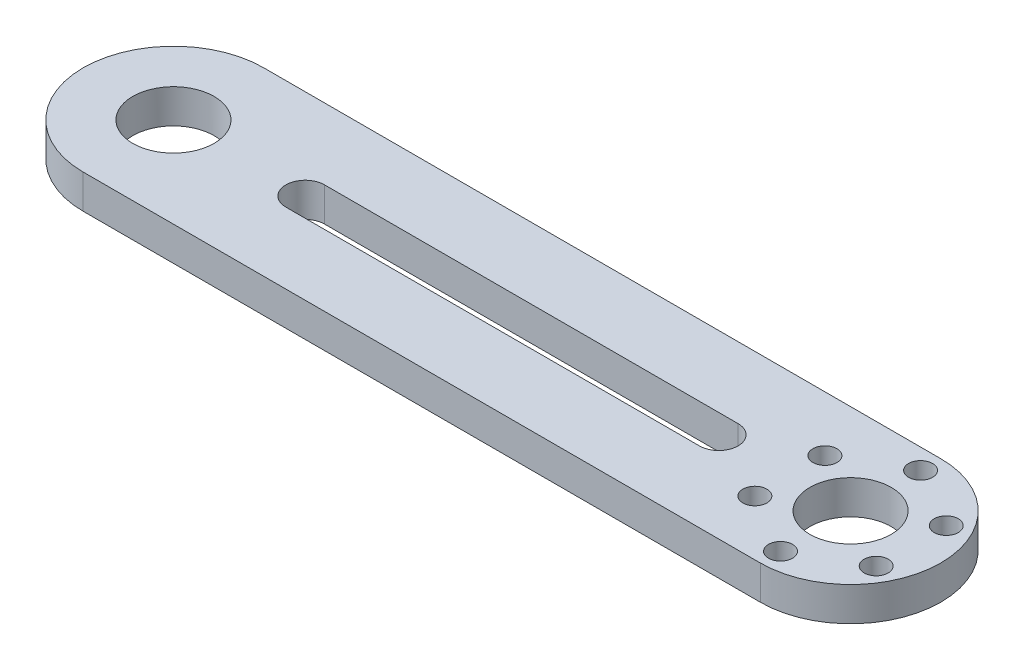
from build123d import *

# Parameters (mm, degrees)
BOSS_EXTRUDE1_DEPTH = 5.12
CUT_EXTRUDE1_REACH  = 68.214
SKETCH2_R           = 6.13
SKETCH2_R_2         = 1.81


with BuildPart() as part:
    # Sketch1 → Boss-Extrude1 (new body)
    with BuildSketch(Plane(origin=(0, 0, 0), x_dir=(1, 0, 0), z_dir=(0, 1, 0))):
        with BuildLine():
            Line((51, -13.6), (-51, -13.6))
            ThreePointArc((-51, -13.6), (-64.6, 0), (-51, 13.6))
            Line((-51, 13.6), (51, 13.6))
            ThreePointArc((51, 13.6), (64.6, 0), (51, -13.6))
        make_face()
        with BuildLine():
            Line((31.15, -2.91), (-31.15, -2.91))
            ThreePointArc((-31.15, -2.91), (-34.06, 0), (-31.15, 2.91))
            Line((-31.15, 2.91), (31.15, 2.91))
            ThreePointArc((31.15, 2.91), (34.06, 0), (31.15, -2.91))
        make_face(mode=Mode.SUBTRACT)
    extrude(amount=BOSS_EXTRUDE1_DEPTH)

    # Sketch2 → Cut-Extrude1 (cut, up to next)
    with BuildSketch(Plane(origin=(0, 5.12, 0), x_dir=(1, 0, 0), z_dir=(0, 1, 0)), mode=Mode.PRIVATE) as cut_extrude1_sk1:
        with Locations(Location((51, 0, 0), (0, 0, 270))):
            Circle(SKETCH2_R)
    cut_extrude1_tool1 = extrude(cut_extrude1_sk1.sketch, amount=-CUT_EXTRUDE1_REACH, mode=Mode.PRIVATE) & part.part
    # Sketch2 → Cut-Extrude1 (cut, up to next)
    with BuildSketch(Plane(origin=(0, 5.12, 0), x_dir=(1, 0, 0), z_dir=(0, 1, 0)), mode=Mode.PRIVATE) as cut_extrude1_sk2:
        with Locations(Location((51, 10.55, 0), (0, 0, 270))):
            Circle(SKETCH2_R_2)
    cut_extrude1_tool2 = extrude(cut_extrude1_sk2.sketch, amount=-CUT_EXTRUDE1_REACH, mode=Mode.PRIVATE) & part.part
    # Sketch2 → Cut-Extrude1 (cut, up to next)
    with BuildSketch(Plane(origin=(0, 5.12, 0), x_dir=(1, 0, 0), z_dir=(0, 1, 0)), mode=Mode.PRIVATE) as cut_extrude1_sk3:
        with Locations(Location((60.13656801, 5.275, 0), (0, 0, 270))):
            Circle(SKETCH2_R_2)
    cut_extrude1_tool3 = extrude(cut_extrude1_sk3.sketch, amount=-CUT_EXTRUDE1_REACH, mode=Mode.PRIVATE) & part.part
    # Sketch2 → Cut-Extrude1 (cut, up to next)
    with BuildSketch(Plane(origin=(0, 5.12, 0), x_dir=(1, 0, 0), z_dir=(0, 1, 0)), mode=Mode.PRIVATE) as cut_extrude1_sk4:
        with Locations(Location((60.13656801, -5.275, 0), (0, 0, 270))):
            Circle(SKETCH2_R_2)
    cut_extrude1_tool4 = extrude(cut_extrude1_sk4.sketch, amount=-CUT_EXTRUDE1_REACH, mode=Mode.PRIVATE) & part.part
    # Sketch2 → Cut-Extrude1 (cut, up to next)
    with BuildSketch(Plane(origin=(0, 5.12, 0), x_dir=(1, 0, 0), z_dir=(0, 1, 0)), mode=Mode.PRIVATE) as cut_extrude1_sk5:
        with Locations(Location((51, -10.55, 0), (0, 0, 270))):
            Circle(SKETCH2_R_2)
    cut_extrude1_tool5 = extrude(cut_extrude1_sk5.sketch, amount=-CUT_EXTRUDE1_REACH, mode=Mode.PRIVATE) & part.part
    # Sketch2 → Cut-Extrude1 (cut, up to next)
    with BuildSketch(Plane(origin=(0, 5.12, 0), x_dir=(1, 0, 0), z_dir=(0, 1, 0)), mode=Mode.PRIVATE) as cut_extrude1_sk6:
        with Locations(Location((41.86343199, -5.275, 0), (0, 0, 270))):
            Circle(SKETCH2_R_2)
    cut_extrude1_tool6 = extrude(cut_extrude1_sk6.sketch, amount=-CUT_EXTRUDE1_REACH, mode=Mode.PRIVATE) & part.part
    # Sketch2 → Cut-Extrude1 (cut, up to next)
    with BuildSketch(Plane(origin=(0, 5.12, 0), x_dir=(1, 0, 0), z_dir=(0, 1, 0)), mode=Mode.PRIVATE) as cut_extrude1_sk7:
        with Locations(Location((41.86343199, 5.275, 0), (0, 0, 270))):
            Circle(SKETCH2_R_2)
    cut_extrude1_tool7 = extrude(cut_extrude1_sk7.sketch, amount=-CUT_EXTRUDE1_REACH, mode=Mode.PRIVATE) & part.part
    # Sketch2 → Cut-Extrude1 (cut, up to next)
    with BuildSketch(Plane(origin=(0, 5.12, 0), x_dir=(1, 0, 0), z_dir=(0, 1, 0)), mode=Mode.PRIVATE) as cut_extrude1_sk8:
        with Locations(Location((-51, 0, 0), (0, 0, 270))):
            Circle(SKETCH2_R)
    cut_extrude1_tool8 = extrude(cut_extrude1_sk8.sketch, amount=-CUT_EXTRUDE1_REACH, mode=Mode.PRIVATE) & part.part
    add(cut_extrude1_tool1.solids().sort_by_distance((51, 5.12, 0))[0], mode=Mode.SUBTRACT)
    add(cut_extrude1_tool2.solids().sort_by_distance((51, 5.12, -10.55))[0], mode=Mode.SUBTRACT)
    add(cut_extrude1_tool3.solids().sort_by_distance((60.136568, 5.12, -5.275))[0], mode=Mode.SUBTRACT)
    add(cut_extrude1_tool4.solids().sort_by_distance((60.136568, 5.12, 5.275))[0], mode=Mode.SUBTRACT)
    add(cut_extrude1_tool5.solids().sort_by_distance((51, 5.12, 10.55))[0], mode=Mode.SUBTRACT)
    add(cut_extrude1_tool6.solids().sort_by_distance((41.863432, 5.12, 5.275))[0], mode=Mode.SUBTRACT)
    add(cut_extrude1_tool7.solids().sort_by_distance((41.863432, 5.12, -5.275))[0], mode=Mode.SUBTRACT)
    add(cut_extrude1_tool8.solids().sort_by_distance((-51, 5.12, 0))[0], mode=Mode.SUBTRACT)


solid = part.part
